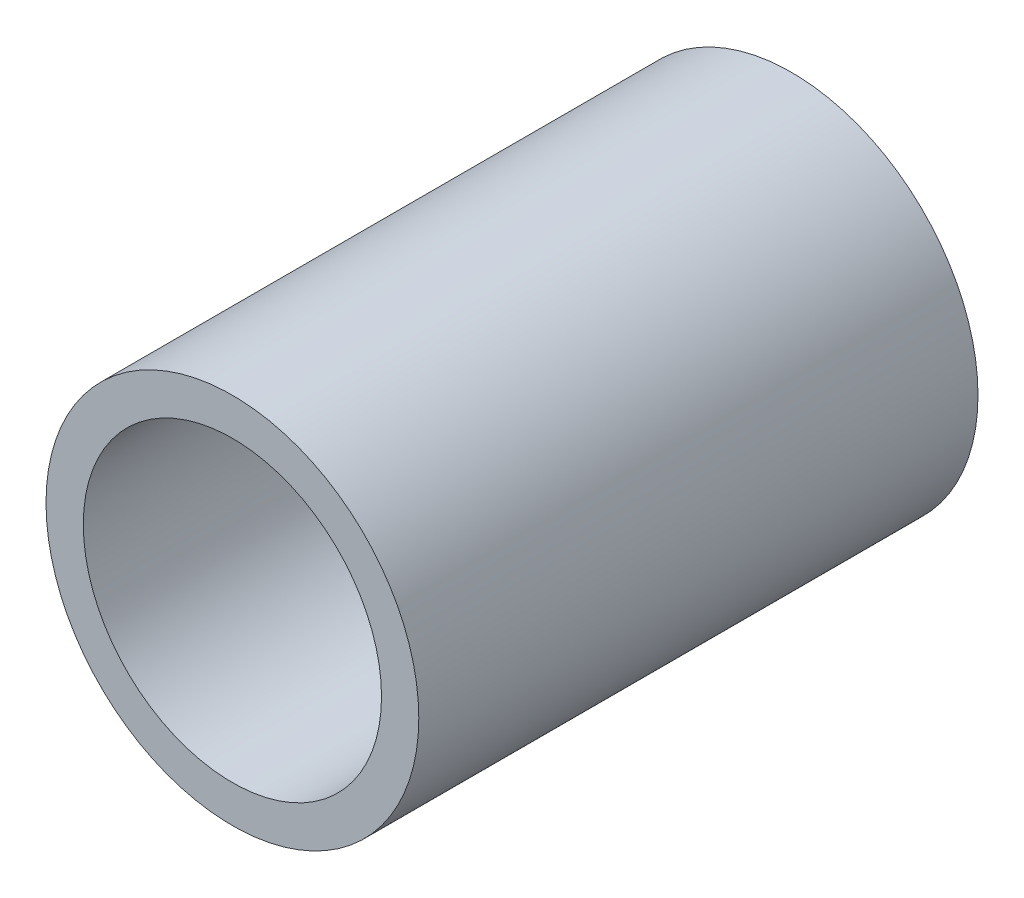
from build123d import *

# Parameters (mm, degrees)
SKETCH1_R           = 50
SKETCH1_R_2         = 40
BOSS_EXTRUDE1_DEPTH = 150


with BuildPart() as part:
    # Sketch1 → Boss-Extrude1 (new body)
    with BuildSketch(Plane.XY):
        Circle(SKETCH1_R)
        Circle(SKETCH1_R_2, mode=Mode.SUBTRACT)
    extrude(amount=BOSS_EXTRUDE1_DEPTH)


solid = part.part
